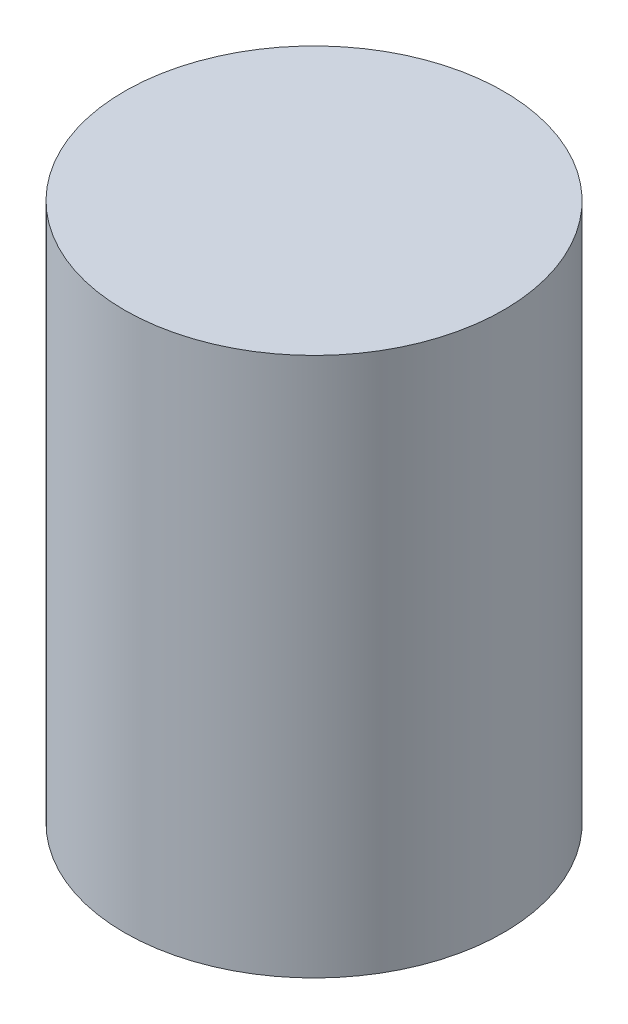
ISO-10303-21;
HEADER;
FILE_DESCRIPTION(('STEP AP214'),'2;1');
FILE_NAME('part.step','',(''),(''),'','','');
FILE_SCHEMA(('AUTOMOTIVE_DESIGN { 1 0 10303 214 1 1 1 1 }'));
ENDSEC;
DATA;
#1=APPLICATION_CONTEXT('core data for automotive mechanical design processes');
#2=APPLICATION_PROTOCOL_DEFINITION('international standard','automotive_design',2000,#1);
#3=PRODUCT_CONTEXT('',#1,'mechanical');
#4=PRODUCT('Part','Part','',(#3));
#5=PRODUCT_RELATED_PRODUCT_CATEGORY('part','',(#4));
#6=PRODUCT_DEFINITION_FORMATION('','',#4);
#7=PRODUCT_DEFINITION_CONTEXT('part definition',#1,'design');
#8=PRODUCT_DEFINITION('design','',#6,#7);
#9=PRODUCT_DEFINITION_SHAPE('','',#8);
#10=(LENGTH_UNIT() NAMED_UNIT(*) SI_UNIT(.MILLI.,.METRE.));
#11=(NAMED_UNIT(*) PLANE_ANGLE_UNIT() SI_UNIT($,.RADIAN.));
#12=(NAMED_UNIT(*) SI_UNIT($,.STERADIAN.) SOLID_ANGLE_UNIT());
#13=UNCERTAINTY_MEASURE_WITH_UNIT(LENGTH_MEASURE(1.E-05),#10,'distance_accuracy_value','');
#14=(GEOMETRIC_REPRESENTATION_CONTEXT(3) GLOBAL_UNCERTAINTY_ASSIGNED_CONTEXT((#13)) GLOBAL_UNIT_ASSIGNED_CONTEXT((#10,
#11,#12)) REPRESENTATION_CONTEXT('',''));
#15=CARTESIAN_POINT('',(0.,0.,0.));
#16=DIRECTION('',(0.,0.,1.));
#17=DIRECTION('',(1.,0.,0.));
#18=AXIS2_PLACEMENT_3D('',#15,#16,#17);
#19=CARTESIAN_POINT('',(0.,64.,0.));
#20=DIRECTION('',(0.,-1.,0.));
#21=DIRECTION('',(0.,0.,-1.));
#22=AXIS2_PLACEMENT_3D('',#19,#20,#21);
#23=CYLINDRICAL_SURFACE('',#22,22.5);
#24=CARTESIAN_POINT('',(0.,64.,0.));
#25=DIRECTION('',(0.,1.,0.));
#26=DIRECTION('',(0.,0.,1.));
#27=AXIS2_PLACEMENT_3D('',#24,#25,#26);
#28=CIRCLE('',#27,22.5);
#29=CARTESIAN_POINT('',(0.,64.,22.5));
#30=VERTEX_POINT('',#29);
#31=EDGE_CURVE('E10',#30,#30,#28,.T.);
#32=ORIENTED_EDGE('',*,*,#31,.F.);
#33=EDGE_LOOP('',(#32));
#34=FACE_BOUND('',#33,.T.);
#35=CARTESIAN_POINT('',(0.,0.,0.));
#36=DIRECTION('',(0.,1.,0.));
#37=DIRECTION('',(0.,0.,1.));
#38=AXIS2_PLACEMENT_3D('',#35,#36,#37);
#39=CIRCLE('',#38,22.5);
#40=CARTESIAN_POINT('',(0.,0.,22.5));
#41=VERTEX_POINT('',#40);
#42=EDGE_CURVE('E31',#41,#41,#39,.T.);
#43=ORIENTED_EDGE('',*,*,#42,.T.);
#44=EDGE_LOOP('',(#43));
#45=FACE_BOUND('',#44,.T.);
#46=ADVANCED_FACE('F28',(#34,#45),#23,.T.);
#47=CARTESIAN_POINT('',(0.,64.,0.));
#48=DIRECTION('',(0.,1.,0.));
#49=DIRECTION('',(0.,0.,1.));
#50=AXIS2_PLACEMENT_3D('',#47,#48,#49);
#51=PLANE('',#50);
#52=ORIENTED_EDGE('',*,*,#31,.T.);
#53=EDGE_LOOP('',(#52));
#54=FACE_BOUND('',#53,.T.);
#55=ADVANCED_FACE('F43',(#54),#51,.T.);
#56=CARTESIAN_POINT('',(0.,0.,0.));
#57=DIRECTION('',(0.,1.,0.));
#58=DIRECTION('',(0.,0.,1.));
#59=AXIS2_PLACEMENT_3D('',#56,#57,#58);
#60=PLANE('',#59);
#61=ORIENTED_EDGE('',*,*,#42,.F.);
#62=EDGE_LOOP('',(#61));
#63=FACE_BOUND('',#62,.T.);
#64=ADVANCED_FACE('F41',(#63),#60,.F.);
#65=CLOSED_SHELL('',(#46,#55,#64));
#66=MANIFOLD_SOLID_BREP('B2',#65);
#67=ADVANCED_BREP_SHAPE_REPRESENTATION('',(#18,#66),#14);
#68=SHAPE_DEFINITION_REPRESENTATION(#9,#67);
ENDSEC;
END-ISO-10303-21;
